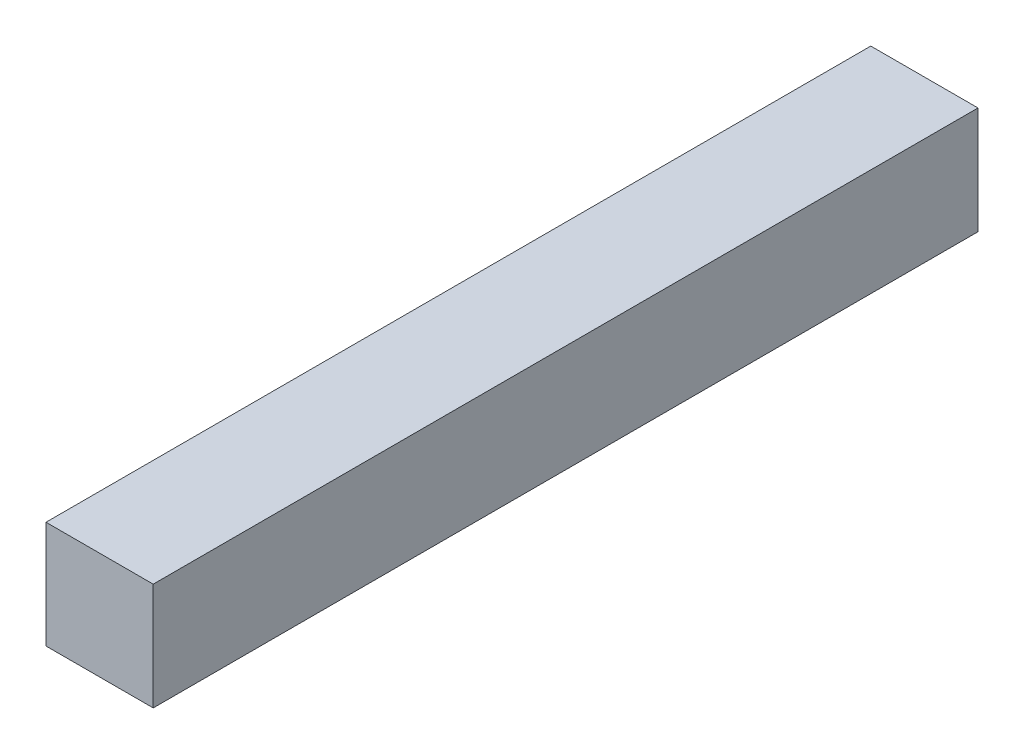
from build123d import *

# Parameters (mm, degrees)
ESQUISSE1_W      = 13
ESQUISSE1_H      = 13
EXTRUSION1_DEPTH = 50


with BuildPart() as part:
    # Esquisse1 → Extrusion1 (new, symmetric)
    with BuildSketch(Plane.XY):
        Rectangle(ESQUISSE1_W, ESQUISSE1_H)
    extrude(amount=EXTRUSION1_DEPTH, both=True)


solid = part.part
